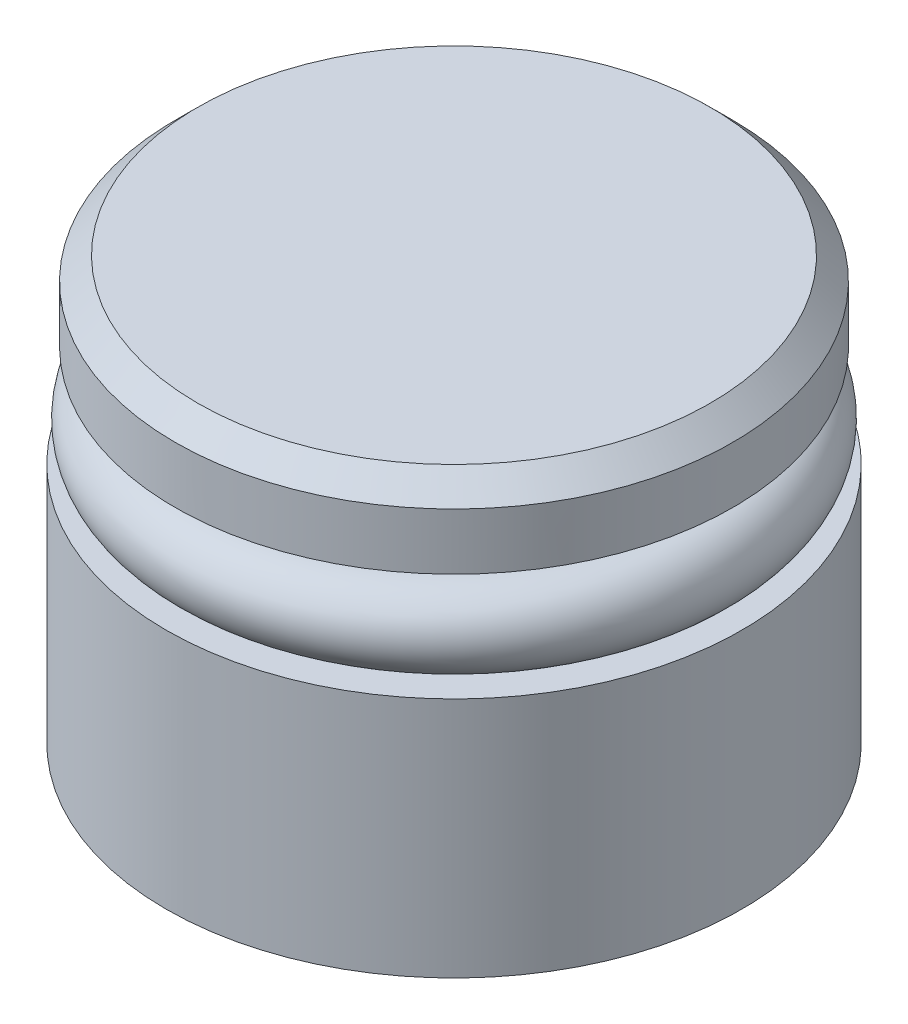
ISO-10303-21;
HEADER;
FILE_DESCRIPTION(('STEP AP214'),'2;1');
FILE_NAME('part.step','',(''),(''),'','','');
FILE_SCHEMA(('AUTOMOTIVE_DESIGN { 1 0 10303 214 1 1 1 1 }'));
ENDSEC;
DATA;
#1=APPLICATION_CONTEXT('core data for automotive mechanical design processes');
#2=APPLICATION_PROTOCOL_DEFINITION('international standard','automotive_design',2000,#1);
#3=PRODUCT_CONTEXT('',#1,'mechanical');
#4=PRODUCT('Part','Part','',(#3));
#5=PRODUCT_RELATED_PRODUCT_CATEGORY('part','',(#4));
#6=PRODUCT_DEFINITION_FORMATION('','',#4);
#7=PRODUCT_DEFINITION_CONTEXT('part definition',#1,'design');
#8=PRODUCT_DEFINITION('design','',#6,#7);
#9=PRODUCT_DEFINITION_SHAPE('','',#8);
#10=(LENGTH_UNIT() NAMED_UNIT(*) SI_UNIT(.MILLI.,.METRE.));
#11=(NAMED_UNIT(*) PLANE_ANGLE_UNIT() SI_UNIT($,.RADIAN.));
#12=(NAMED_UNIT(*) SI_UNIT($,.STERADIAN.) SOLID_ANGLE_UNIT());
#13=UNCERTAINTY_MEASURE_WITH_UNIT(LENGTH_MEASURE(1.E-05),#10,'distance_accuracy_value','');
#14=(GEOMETRIC_REPRESENTATION_CONTEXT(3) GLOBAL_UNCERTAINTY_ASSIGNED_CONTEXT((#13)) GLOBAL_UNIT_ASSIGNED_CONTEXT((#10,
#11,#12)) REPRESENTATION_CONTEXT('',''));
#15=CARTESIAN_POINT('',(0.,0.,0.));
#16=DIRECTION('',(0.,0.,1.));
#17=DIRECTION('',(1.,0.,0.));
#18=AXIS2_PLACEMENT_3D('',#15,#16,#17);
#19=CARTESIAN_POINT('',(0.,0.,0.));
#20=DIRECTION('',(0.,-1.,0.));
#21=DIRECTION('',(0.,0.,-1.));
#22=AXIS2_PLACEMENT_3D('',#19,#20,#21);
#23=PLANE('',#22);
#24=CARTESIAN_POINT('',(0.,0.,0.));
#25=DIRECTION('',(0.,-1.,0.));
#26=DIRECTION('',(0.,0.,-1.));
#27=AXIS2_PLACEMENT_3D('',#24,#25,#26);
#28=CIRCLE('',#27,2.5527);
#29=CARTESIAN_POINT('',(0.,0.,-2.5527));
#30=VERTEX_POINT('',#29);
#31=EDGE_CURVE('P0_E37',#30,#30,#28,.T.);
#32=ORIENTED_EDGE('',*,*,#31,.F.);
#33=EDGE_LOOP('',(#32));
#34=FACE_BOUND('',#33,.T.);
#35=CARTESIAN_POINT('',(0.,0.,0.));
#36=DIRECTION('',(0.,-1.,0.));
#37=DIRECTION('',(0.,0.,-1.));
#38=AXIS2_PLACEMENT_3D('',#35,#36,#37);
#39=CIRCLE('',#38,6.477);
#40=CARTESIAN_POINT('',(0.,0.,-6.477));
#41=VERTEX_POINT('',#40);
#42=EDGE_CURVE('P0_E53',#41,#41,#39,.T.);
#43=ORIENTED_EDGE('',*,*,#42,.T.);
#44=EDGE_LOOP('',(#43));
#45=FACE_BOUND('',#44,.T.);
#46=ADVANCED_FACE('P0_F16',(#34,#45),#23,.T.);
#47=CARTESIAN_POINT('',(0.,0.,0.));
#48=DIRECTION('',(0.,-1.,0.));
#49=DIRECTION('',(0.,0.,-1.));
#50=AXIS2_PLACEMENT_3D('',#47,#48,#49);
#51=CYLINDRICAL_SURFACE('',#50,6.477);
#52=CARTESIAN_POINT('',(0.,5.4356,0.));
#53=DIRECTION('',(0.,-1.,0.));
#54=DIRECTION('',(0.,0.,-1.));
#55=AXIS2_PLACEMENT_3D('',#52,#53,#54);
#56=CIRCLE('',#55,6.477);
#57=CARTESIAN_POINT('',(0.,5.4356,-6.477));
#58=VERTEX_POINT('',#57);
#59=EDGE_CURVE('P0_E50',#58,#58,#56,.T.);
#60=ORIENTED_EDGE('',*,*,#59,.T.);
#61=EDGE_LOOP('',(#60));
#62=FACE_BOUND('',#61,.T.);
#63=ORIENTED_EDGE('',*,*,#42,.F.);
#64=EDGE_LOOP('',(#63));
#65=FACE_BOUND('',#64,.T.);
#66=ADVANCED_FACE('P0_F70',(#62,#65),#51,.T.);
#67=CARTESIAN_POINT('',(6.477,5.4356,0.));
#68=DIRECTION('',(0.,1.,0.));
#69=DIRECTION('',(0.,0.,1.));
#70=AXIS2_PLACEMENT_3D('',#67,#68,#69);
#71=PLANE('',#70);
#72=CARTESIAN_POINT('',(0.,5.4356,0.));
#73=DIRECTION('',(0.,-1.,0.));
#74=DIRECTION('',(0.,0.,-1.));
#75=AXIS2_PLACEMENT_3D('',#72,#73,#74);
#76=CIRCLE('',#75,4.92125);
#77=CARTESIAN_POINT('',(0.,5.4356,-4.92125));
#78=VERTEX_POINT('',#77);
#79=EDGE_CURVE('P0_E47',#78,#78,#76,.T.);
#80=ORIENTED_EDGE('',*,*,#79,.T.);
#81=EDGE_LOOP('',(#80));
#82=FACE_BOUND('',#81,.T.);
#83=ORIENTED_EDGE('',*,*,#59,.F.);
#84=EDGE_LOOP('',(#83));
#85=FACE_BOUND('',#84,.T.);
#86=ADVANCED_FACE('P0_F75',(#82,#85),#71,.T.);
#87=CARTESIAN_POINT('',(0.,0.,0.));
#88=DIRECTION('',(0.,-1.,0.));
#89=DIRECTION('',(0.,0.,-1.));
#90=AXIS2_PLACEMENT_3D('',#87,#88,#89);
#91=CYLINDRICAL_SURFACE('',#90,4.92125);
#92=CARTESIAN_POINT('',(0.,7.7216,0.));
#93=DIRECTION('',(0.,-1.,0.));
#94=DIRECTION('',(0.,0.,-1.));
#95=AXIS2_PLACEMENT_3D('',#92,#93,#94);
#96=CIRCLE('',#95,4.92125);
#97=CARTESIAN_POINT('',(0.,7.7216,-4.92125));
#98=VERTEX_POINT('',#97);
#99=EDGE_CURVE('P0_E40',#98,#98,#96,.T.);
#100=ORIENTED_EDGE('',*,*,#99,.T.);
#101=EDGE_LOOP('',(#100));
#102=FACE_BOUND('',#101,.T.);
#103=ORIENTED_EDGE('',*,*,#79,.F.);
#104=EDGE_LOOP('',(#103));
#105=FACE_BOUND('',#104,.T.);
#106=ADVANCED_FACE('P0_F83',(#102,#105),#91,.T.);
#107=CARTESIAN_POINT('',(4.92125,7.7216,0.));
#108=DIRECTION('',(0.,-1.,0.));
#109=DIRECTION('',(0.,0.,-1.));
#110=AXIS2_PLACEMENT_3D('',#107,#108,#109);
#111=PLANE('',#110);
#112=CARTESIAN_POINT('',(0.,7.7216,0.));
#113=DIRECTION('',(0.,-1.,0.));
#114=DIRECTION('',(0.,0.,-1.));
#115=AXIS2_PLACEMENT_3D('',#112,#113,#114);
#116=CIRCLE('',#115,6.2738);
#117=CARTESIAN_POINT('',(0.,7.7216,-6.2738));
#118=VERTEX_POINT('',#117);
#119=EDGE_CURVE('P0_E36',#118,#118,#116,.T.);
#120=ORIENTED_EDGE('',*,*,#119,.T.);
#121=EDGE_LOOP('',(#120));
#122=FACE_BOUND('',#121,.T.);
#123=ORIENTED_EDGE('',*,*,#99,.F.);
#124=EDGE_LOOP('',(#123));
#125=FACE_BOUND('',#124,.T.);
#126=ADVANCED_FACE('P0_F87',(#122,#125),#111,.T.);
#127=CARTESIAN_POINT('',(0.,0.,0.));
#128=DIRECTION('',(0.,-1.,0.));
#129=DIRECTION('',(0.,0.,-1.));
#130=AXIS2_PLACEMENT_3D('',#127,#128,#129);
#131=CYLINDRICAL_SURFACE('',#130,6.2738);
#132=CARTESIAN_POINT('',(0.,8.9916,0.));
#133=DIRECTION('',(0.,1.,0.));
#134=DIRECTION('',(0.,0.,1.));
#135=AXIS2_PLACEMENT_3D('',#132,#133,#134);
#136=CIRCLE('',#135,6.2738);
#137=CARTESIAN_POINT('',(0.,8.9916,6.2738));
#138=VERTEX_POINT('',#137);
#139=EDGE_CURVE('P0_E23',#138,#138,#136,.F.);
#140=ORIENTED_EDGE('',*,*,#139,.T.);
#141=EDGE_LOOP('',(#140));
#142=FACE_BOUND('',#141,.T.);
#143=ORIENTED_EDGE('',*,*,#119,.F.);
#144=EDGE_LOOP('',(#143));
#145=FACE_BOUND('',#144,.T.);
#146=ADVANCED_FACE('P0_F58',(#142,#145),#131,.T.);
#147=CARTESIAN_POINT('',(6.2738,9.4996,0.));
#148=DIRECTION('',(0.,1.,0.));
#149=DIRECTION('',(0.,0.,1.));
#150=AXIS2_PLACEMENT_3D('',#147,#148,#149);
#151=PLANE('',#150);
#152=CARTESIAN_POINT('',(0.,9.4996,0.));
#153=DIRECTION('',(0.,1.,0.));
#154=DIRECTION('',(0.,0.,1.));
#155=AXIS2_PLACEMENT_3D('',#152,#153,#154);
#156=CIRCLE('',#155,5.76579999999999);
#157=CARTESIAN_POINT('',(0.,9.4996,5.76579999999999));
#158=VERTEX_POINT('',#157);
#159=EDGE_CURVE('P0_E11',#158,#158,#156,.T.);
#160=ORIENTED_EDGE('',*,*,#159,.T.);
#161=EDGE_LOOP('',(#160));
#162=FACE_BOUND('',#161,.T.);
#163=ADVANCED_FACE('P0_F30',(#162),#151,.T.);
#164=CARTESIAN_POINT('',(0.,6.35,0.));
#165=DIRECTION('',(0.,-1.,0.));
#166=DIRECTION('',(0.,0.,-1.));
#167=AXIS2_PLACEMENT_3D('',#164,#165,#166);
#168=CONICAL_SURFACE('',#167,2.5527,1.02974425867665);
#169=CARTESIAN_POINT('',(0.,7.88381690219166,0.));
#170=VERTEX_POINT('',#169);
#171=VERTEX_LOOP('',#170);
#172=FACE_BOUND('',#171,.T.);
#173=CARTESIAN_POINT('',(0.,6.35,0.));
#174=DIRECTION('',(0.,-1.,0.));
#175=DIRECTION('',(0.,0.,-1.));
#176=AXIS2_PLACEMENT_3D('',#173,#174,#175);
#177=CIRCLE('',#176,2.5527);
#178=CARTESIAN_POINT('',(0.,6.35,-2.5527));
#179=VERTEX_POINT('',#178);
#180=EDGE_CURVE('P0_E34',#179,#179,#177,.T.);
#181=ORIENTED_EDGE('',*,*,#180,.T.);
#182=EDGE_LOOP('',(#181));
#183=FACE_BOUND('',#182,.T.);
#184=ADVANCED_FACE('P0_F26',(#172,#183),#168,.F.);
#185=CARTESIAN_POINT('',(0.,0.,0.));
#186=DIRECTION('',(0.,-1.,0.));
#187=DIRECTION('',(0.,0.,-1.));
#188=AXIS2_PLACEMENT_3D('',#185,#186,#187);
#189=CYLINDRICAL_SURFACE('',#188,2.5527);
#190=ORIENTED_EDGE('',*,*,#180,.F.);
#191=EDGE_LOOP('',(#190));
#192=FACE_BOUND('',#191,.T.);
#193=ORIENTED_EDGE('',*,*,#31,.T.);
#194=EDGE_LOOP('',(#193));
#195=FACE_BOUND('',#194,.T.);
#196=ADVANCED_FACE('P0_F29',(#192,#195),#189,.F.);
#197=CARTESIAN_POINT('',(0.,8.9916,0.));
#198=DIRECTION('',(0.,-1.,0.));
#199=DIRECTION('',(0.,0.,-1.));
#200=AXIS2_PLACEMENT_3D('',#197,#198,#199);
#201=CONICAL_SURFACE('',#200,6.2738,0.78539816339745);
#202=ORIENTED_EDGE('',*,*,#159,.F.);
#203=EDGE_LOOP('',(#202));
#204=FACE_BOUND('',#203,.T.);
#205=ORIENTED_EDGE('',*,*,#139,.F.);
#206=EDGE_LOOP('',(#205));
#207=FACE_BOUND('',#206,.T.);
#208=ADVANCED_FACE('P0_F18',(#204,#207),#201,.T.);
#209=CLOSED_SHELL('',(#46,#66,#86,#106,#126,#146,#163,#184,#196,#208));
#210=MANIFOLD_SOLID_BREP('P0_B1',#209);
#211=CARTESIAN_POINT('',(0.,6.3246,0.));
#212=DIRECTION('',(0.,-1.,0.));
#213=DIRECTION('',(0.,0.,-1.));
#214=AXIS2_PLACEMENT_3D('',#211,#212,#213);
#215=TOROIDAL_SURFACE('',#214,5.5118,0.889);
#216=CARTESIAN_POINT('',(0.,6.3246,-6.4008));
#217=VERTEX_POINT('',#216);
#218=VERTEX_LOOP('',#217);
#219=FACE_BOUND('',#218,.T.);
#220=ADVANCED_FACE('P1_F12',(#219),#215,.T.);
#221=CLOSED_SHELL('',(#220));
#222=MANIFOLD_SOLID_BREP('P1_B1',#221);
#223=ADVANCED_BREP_SHAPE_REPRESENTATION('',(#18,#210,#222),#14);
#224=SHAPE_DEFINITION_REPRESENTATION(#9,#223);
ENDSEC;
END-ISO-10303-21;
